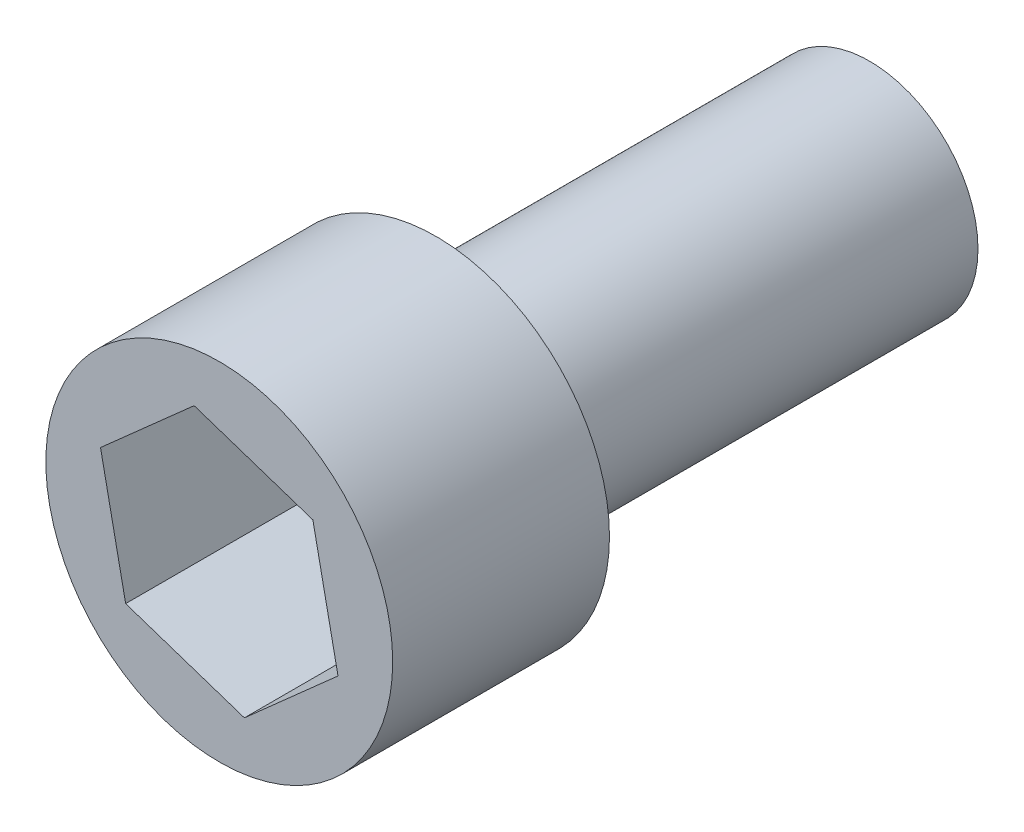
from build123d import *

# Parameters (mm, degrees)
SKETCH_1_R          = 5
EXTRUDE_1_DEPTH     = 20
SKETCH_2_R          = 8
EXTRUDE_2_DEPTH     = 10
CUT_EXTRUDE_2_DEPTH = 9.5


with BuildPart() as part:
    # Sketch 1 → Extrude 1 (new body)
    with BuildSketch(Plane.XY):
        Circle(SKETCH_1_R)
    extrude(amount=EXTRUDE_1_DEPTH)

    # Sketch 2 → Extrude 2 (add)
    with BuildSketch(Plane.XY.offset(20)):
        Circle(SKETCH_2_R)
    extrude(amount=EXTRUDE_2_DEPTH)

    # Sketch 3 → Cut-Extrude 2 (cut)
    with BuildSketch(Plane.XY.offset(30)):
        Polygon((-1.159313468, 5.65591068), (-5.477819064, 1.823960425), (-4.318505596, -3.831950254), (1.159313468, -5.65591068), (5.477819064, -1.823960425), (4.318505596, 3.831950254), align=None)
    extrude(amount=-CUT_EXTRUDE_2_DEPTH, mode=Mode.SUBTRACT)


solid = part.part
